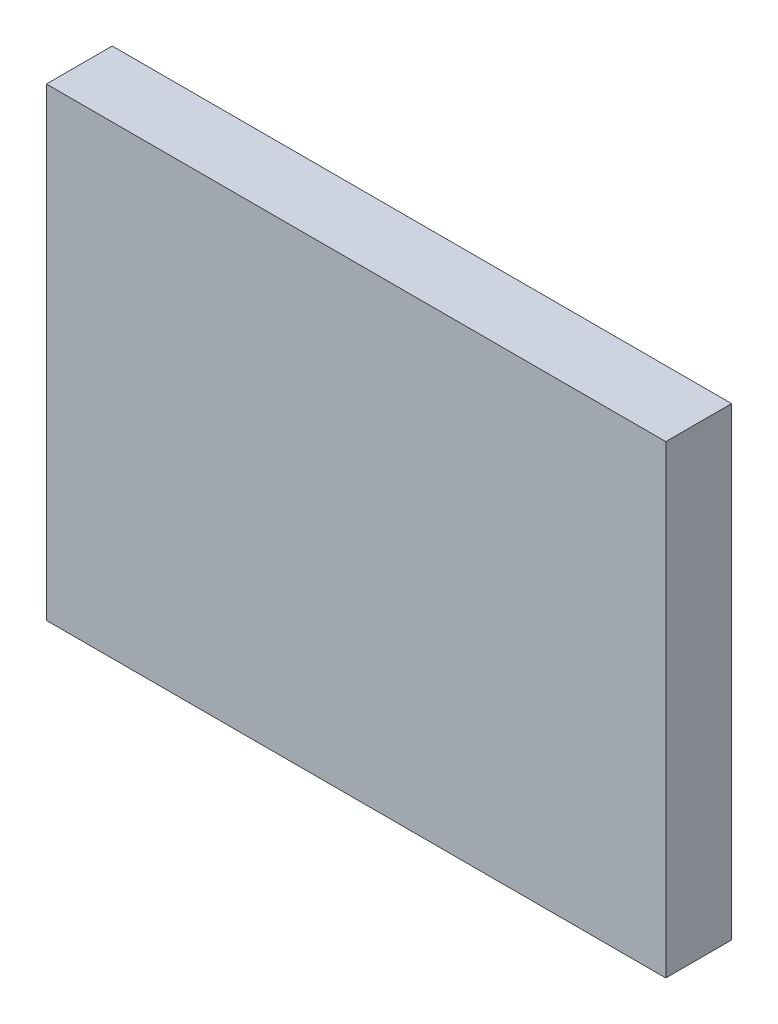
ISO-10303-21;
HEADER;
FILE_DESCRIPTION(('STEP AP214'),'2;1');
FILE_NAME('part.step','',(''),(''),'','','');
FILE_SCHEMA(('AUTOMOTIVE_DESIGN { 1 0 10303 214 1 1 1 1 }'));
ENDSEC;
DATA;
#1=APPLICATION_CONTEXT('core data for automotive mechanical design processes');
#2=APPLICATION_PROTOCOL_DEFINITION('international standard','automotive_design',2000,#1);
#3=PRODUCT_CONTEXT('',#1,'mechanical');
#4=PRODUCT('Part','Part','',(#3));
#5=PRODUCT_RELATED_PRODUCT_CATEGORY('part','',(#4));
#6=PRODUCT_DEFINITION_FORMATION('','',#4);
#7=PRODUCT_DEFINITION_CONTEXT('part definition',#1,'design');
#8=PRODUCT_DEFINITION('design','',#6,#7);
#9=PRODUCT_DEFINITION_SHAPE('','',#8);
#10=(LENGTH_UNIT() NAMED_UNIT(*) SI_UNIT(.MILLI.,.METRE.));
#11=(NAMED_UNIT(*) PLANE_ANGLE_UNIT() SI_UNIT($,.RADIAN.));
#12=(NAMED_UNIT(*) SI_UNIT($,.STERADIAN.) SOLID_ANGLE_UNIT());
#13=UNCERTAINTY_MEASURE_WITH_UNIT(LENGTH_MEASURE(1.E-05),#10,'distance_accuracy_value','');
#14=(GEOMETRIC_REPRESENTATION_CONTEXT(3) GLOBAL_UNCERTAINTY_ASSIGNED_CONTEXT((#13)) GLOBAL_UNIT_ASSIGNED_CONTEXT((#10,
#11,#12)) REPRESENTATION_CONTEXT('',''));
#15=CARTESIAN_POINT('',(0.,0.,0.));
#16=DIRECTION('',(0.,0.,1.));
#17=DIRECTION('',(1.,0.,0.));
#18=AXIS2_PLACEMENT_3D('',#15,#16,#17);
#19=CARTESIAN_POINT('',(-3.99999962,-2.99999908,0.85));
#20=DIRECTION('',(0.,0.,-1.));
#21=DIRECTION('',(-1.,0.,0.));
#22=AXIS2_PLACEMENT_3D('',#19,#20,#21);
#23=PLANE('',#22);
#24=DIRECTION('',(0.,1.,0.));
#25=VECTOR('',#24,1.);
#26=CARTESIAN_POINT('',(4.00000216,-2.99999908,0.85));
#27=LINE('',#26,#25);
#28=CARTESIAN_POINT('',(4.00000216,-2.99999908,0.85));
#29=VERTEX_POINT('',#28);
#30=CARTESIAN_POINT('',(4.00000216,2.99999908,0.85));
#31=VERTEX_POINT('',#30);
#32=EDGE_CURVE('E55',#29,#31,#27,.T.);
#33=ORIENTED_EDGE('',*,*,#32,.T.);
#34=DIRECTION('',(1.,0.,0.));
#35=VECTOR('',#34,1.);
#36=CARTESIAN_POINT('',(4.00000216,2.99999908,0.85));
#37=LINE('',#36,#35);
#38=CARTESIAN_POINT('',(-3.99999962,2.99999908,0.85));
#39=VERTEX_POINT('',#38);
#40=EDGE_CURVE('E57',#31,#39,#37,.F.);
#41=ORIENTED_EDGE('',*,*,#40,.T.);
#42=DIRECTION('',(0.,1.,0.));
#43=VECTOR('',#42,1.);
#44=CARTESIAN_POINT('',(-3.99999962,2.99999908,0.85));
#45=LINE('',#44,#43);
#46=CARTESIAN_POINT('',(-3.99999962,-2.99999908,0.85));
#47=VERTEX_POINT('',#46);
#48=EDGE_CURVE('E20',#39,#47,#45,.F.);
#49=ORIENTED_EDGE('',*,*,#48,.T.);
#50=DIRECTION('',(1.,0.,0.));
#51=VECTOR('',#50,1.);
#52=CARTESIAN_POINT('',(-3.99999962,-2.99999908,0.85));
#53=LINE('',#52,#51);
#54=EDGE_CURVE('E80',#47,#29,#53,.T.);
#55=ORIENTED_EDGE('',*,*,#54,.T.);
#56=EDGE_LOOP('',(#33,#41,#49,#55));
#57=FACE_BOUND('',#56,.T.);
#58=ADVANCED_FACE('F17',(#57),#23,.F.);
#59=CARTESIAN_POINT('',(-3.99999962,2.99999908,0.));
#60=DIRECTION('',(1.,0.,0.));
#61=DIRECTION('',(0.,0.,-1.));
#62=AXIS2_PLACEMENT_3D('',#59,#60,#61);
#63=PLANE('',#62);
#64=DIRECTION('',(0.,0.,1.));
#65=VECTOR('',#64,1.);
#66=CARTESIAN_POINT('',(-3.99999962,-2.99999908,0.));
#67=LINE('',#66,#65);
#68=CARTESIAN_POINT('',(-3.99999962,-2.99999908,0.));
#69=VERTEX_POINT('',#68);
#70=EDGE_CURVE('E68',#69,#47,#67,.T.);
#71=ORIENTED_EDGE('',*,*,#70,.T.);
#72=ORIENTED_EDGE('',*,*,#48,.F.);
#73=DIRECTION('',(0.,0.,-1.));
#74=VECTOR('',#73,1.);
#75=CARTESIAN_POINT('',(-3.99999962,2.99999908,0.));
#76=LINE('',#75,#74);
#77=CARTESIAN_POINT('',(-3.99999962,2.99999908,0.));
#78=VERTEX_POINT('',#77);
#79=EDGE_CURVE('E63',#39,#78,#76,.T.);
#80=ORIENTED_EDGE('',*,*,#79,.T.);
#81=DIRECTION('',(0.,1.,0.));
#82=VECTOR('',#81,1.);
#83=CARTESIAN_POINT('',(-3.99999962,-2.99999908,0.));
#84=LINE('',#83,#82);
#85=EDGE_CURVE('E83',#69,#78,#84,.T.);
#86=ORIENTED_EDGE('',*,*,#85,.F.);
#87=EDGE_LOOP('',(#71,#72,#80,#86));
#88=FACE_BOUND('',#87,.T.);
#89=ADVANCED_FACE('F65',(#88),#63,.F.);
#90=CARTESIAN_POINT('',(4.00000216,2.99999908,0.));
#91=DIRECTION('',(0.,-1.,0.));
#92=DIRECTION('',(0.,0.,-1.));
#93=AXIS2_PLACEMENT_3D('',#90,#91,#92);
#94=PLANE('',#93);
#95=ORIENTED_EDGE('',*,*,#79,.F.);
#96=ORIENTED_EDGE('',*,*,#40,.F.);
#97=DIRECTION('',(0.,0.,1.));
#98=VECTOR('',#97,1.);
#99=CARTESIAN_POINT('',(4.00000216,2.99999908,0.));
#100=LINE('',#99,#98);
#101=CARTESIAN_POINT('',(4.00000216,2.99999908,0.));
#102=VERTEX_POINT('',#101);
#103=EDGE_CURVE('E75',#31,#102,#100,.F.);
#104=ORIENTED_EDGE('',*,*,#103,.T.);
#105=DIRECTION('',(-1.,0.,0.));
#106=VECTOR('',#105,1.);
#107=CARTESIAN_POINT('',(-3.99999962,2.99999908,0.));
#108=LINE('',#107,#106);
#109=EDGE_CURVE('E72',#78,#102,#108,.F.);
#110=ORIENTED_EDGE('',*,*,#109,.F.);
#111=EDGE_LOOP('',(#95,#96,#104,#110));
#112=FACE_BOUND('',#111,.T.);
#113=ADVANCED_FACE('F70',(#112),#94,.F.);
#114=CARTESIAN_POINT('',(4.00000216,-2.99999908,0.));
#115=DIRECTION('',(-1.,0.,0.));
#116=DIRECTION('',(0.,0.,1.));
#117=AXIS2_PLACEMENT_3D('',#114,#115,#116);
#118=PLANE('',#117);
#119=ORIENTED_EDGE('',*,*,#103,.F.);
#120=ORIENTED_EDGE('',*,*,#32,.F.);
#121=DIRECTION('',(0.,0.,1.));
#122=VECTOR('',#121,1.);
#123=CARTESIAN_POINT('',(4.00000216,-2.99999908,0.));
#124=LINE('',#123,#122);
#125=CARTESIAN_POINT('',(4.00000216,-2.99999908,0.));
#126=VERTEX_POINT('',#125);
#127=EDGE_CURVE('E35',#29,#126,#124,.F.);
#128=ORIENTED_EDGE('',*,*,#127,.T.);
#129=DIRECTION('',(0.,1.,0.));
#130=VECTOR('',#129,1.);
#131=CARTESIAN_POINT('',(4.00000216,-2.99999908,0.));
#132=LINE('',#131,#130);
#133=EDGE_CURVE('E26',#102,#126,#132,.F.);
#134=ORIENTED_EDGE('',*,*,#133,.F.);
#135=EDGE_LOOP('',(#119,#120,#128,#134));
#136=FACE_BOUND('',#135,.T.);
#137=ADVANCED_FACE('F89',(#136),#118,.F.);
#138=CARTESIAN_POINT('',(-3.99999962,-2.99999908,0.));
#139=DIRECTION('',(0.,1.,0.));
#140=DIRECTION('',(0.,0.,1.));
#141=AXIS2_PLACEMENT_3D('',#138,#139,#140);
#142=PLANE('',#141);
#143=ORIENTED_EDGE('',*,*,#127,.F.);
#144=ORIENTED_EDGE('',*,*,#54,.F.);
#145=ORIENTED_EDGE('',*,*,#70,.F.);
#146=DIRECTION('',(-1.,0.,0.));
#147=VECTOR('',#146,1.);
#148=CARTESIAN_POINT('',(-3.99999962,-2.99999908,0.));
#149=LINE('',#148,#147);
#150=EDGE_CURVE('E11',#126,#69,#149,.T.);
#151=ORIENTED_EDGE('',*,*,#150,.F.);
#152=EDGE_LOOP('',(#143,#144,#145,#151));
#153=FACE_BOUND('',#152,.T.);
#154=ADVANCED_FACE('F91',(#153),#142,.F.);
#155=CARTESIAN_POINT('',(-3.99999962,-2.99999908,0.));
#156=DIRECTION('',(0.,0.,-1.));
#157=DIRECTION('',(-1.,0.,0.));
#158=AXIS2_PLACEMENT_3D('',#155,#156,#157);
#159=PLANE('',#158);
#160=ORIENTED_EDGE('',*,*,#133,.T.);
#161=ORIENTED_EDGE('',*,*,#150,.T.);
#162=ORIENTED_EDGE('',*,*,#85,.T.);
#163=ORIENTED_EDGE('',*,*,#109,.T.);
#164=EDGE_LOOP('',(#160,#161,#162,#163));
#165=FACE_BOUND('',#164,.T.);
#166=ADVANCED_FACE('F88',(#165),#159,.T.);
#167=CLOSED_SHELL('',(#58,#89,#113,#137,#154,#166));
#168=MANIFOLD_SOLID_BREP('B1',#167);
#169=ADVANCED_BREP_SHAPE_REPRESENTATION('',(#18,#168),#14);
#170=SHAPE_DEFINITION_REPRESENTATION(#9,#169);
ENDSEC;
END-ISO-10303-21;
